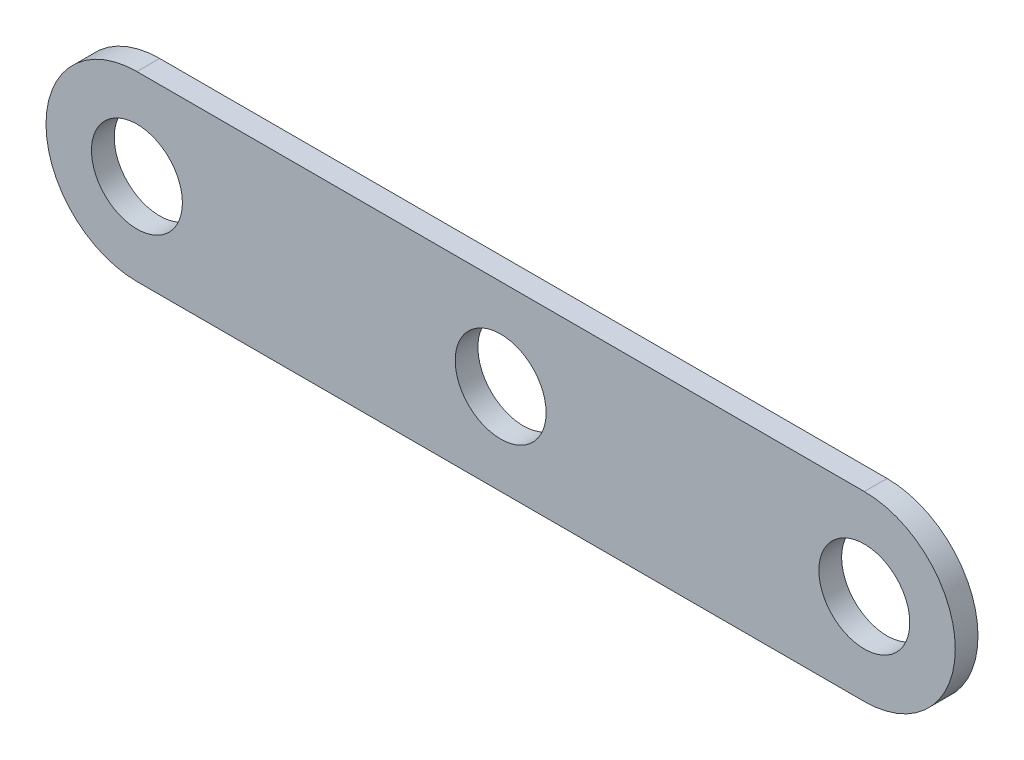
ISO-10303-21;
HEADER;
FILE_DESCRIPTION(('STEP AP214'),'2;1');
FILE_NAME('part.step','',(''),(''),'','','');
FILE_SCHEMA(('AUTOMOTIVE_DESIGN { 1 0 10303 214 1 1 1 1 }'));
ENDSEC;
DATA;
#1=APPLICATION_CONTEXT('core data for automotive mechanical design processes');
#2=APPLICATION_PROTOCOL_DEFINITION('international standard','automotive_design',2000,#1);
#3=PRODUCT_CONTEXT('',#1,'mechanical');
#4=PRODUCT('Part','Part','',(#3));
#5=PRODUCT_RELATED_PRODUCT_CATEGORY('part','',(#4));
#6=PRODUCT_DEFINITION_FORMATION('','',#4);
#7=PRODUCT_DEFINITION_CONTEXT('part definition',#1,'design');
#8=PRODUCT_DEFINITION('design','',#6,#7);
#9=PRODUCT_DEFINITION_SHAPE('','',#8);
#10=(LENGTH_UNIT() NAMED_UNIT(*) SI_UNIT(.MILLI.,.METRE.));
#11=(NAMED_UNIT(*) PLANE_ANGLE_UNIT() SI_UNIT($,.RADIAN.));
#12=(NAMED_UNIT(*) SI_UNIT($,.STERADIAN.) SOLID_ANGLE_UNIT());
#13=UNCERTAINTY_MEASURE_WITH_UNIT(LENGTH_MEASURE(1.E-05),#10,'distance_accuracy_value','');
#14=(GEOMETRIC_REPRESENTATION_CONTEXT(3) GLOBAL_UNCERTAINTY_ASSIGNED_CONTEXT((#13)) GLOBAL_UNIT_ASSIGNED_CONTEXT((#10,
#11,#12)) REPRESENTATION_CONTEXT('',''));
#15=CARTESIAN_POINT('',(0.,0.,0.));
#16=DIRECTION('',(0.,0.,1.));
#17=DIRECTION('',(1.,0.,0.));
#18=AXIS2_PLACEMENT_3D('',#15,#16,#17);
#19=CARTESIAN_POINT('',(-400.,0.,25.));
#20=DIRECTION('',(0.,0.,1.));
#21=DIRECTION('',(1.,0.,0.));
#22=AXIS2_PLACEMENT_3D('',#19,#20,#21);
#23=PLANE('',#22);
#24=CARTESIAN_POINT('',(400.,0.,25.));
#25=DIRECTION('',(0.,0.,1.));
#26=DIRECTION('',(-1.,0.,0.));
#27=AXIS2_PLACEMENT_3D('',#24,#25,#26);
#28=CIRCLE('',#27,50.);
#29=CARTESIAN_POINT('',(350.,0.,25.));
#30=VERTEX_POINT('',#29);
#31=EDGE_CURVE('E118',#30,#30,#28,.T.);
#32=ORIENTED_EDGE('',*,*,#31,.F.);
#33=EDGE_LOOP('',(#32));
#34=FACE_BOUND('',#33,.T.);
#35=CARTESIAN_POINT('',(-400.,0.,25.));
#36=DIRECTION('',(0.,0.,1.));
#37=DIRECTION('',(1.,0.,0.));
#38=AXIS2_PLACEMENT_3D('',#35,#36,#37);
#39=CIRCLE('',#38,100.);
#40=CARTESIAN_POINT('',(-400.,100.,25.));
#41=VERTEX_POINT('',#40);
#42=CARTESIAN_POINT('',(-400.,-100.,25.));
#43=VERTEX_POINT('',#42);
#44=EDGE_CURVE('E88',#41,#43,#39,.T.);
#45=ORIENTED_EDGE('',*,*,#44,.T.);
#46=DIRECTION('',(1.,0.,0.));
#47=VECTOR('',#46,1.);
#48=CARTESIAN_POINT('',(-400.,-100.,25.));
#49=LINE('',#48,#47);
#50=CARTESIAN_POINT('',(400.,-100.,25.));
#51=VERTEX_POINT('',#50);
#52=EDGE_CURVE('E83',#43,#51,#49,.T.);
#53=ORIENTED_EDGE('',*,*,#52,.T.);
#54=CARTESIAN_POINT('',(400.,1.46957615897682E-13,25.));
#55=DIRECTION('',(0.,0.,1.));
#56=DIRECTION('',(1.,0.,0.));
#57=AXIS2_PLACEMENT_3D('',#54,#55,#56);
#58=CIRCLE('',#57,100.);
#59=CARTESIAN_POINT('',(400.,100.,25.));
#60=VERTEX_POINT('',#59);
#61=EDGE_CURVE('E86',#51,#60,#58,.T.);
#62=ORIENTED_EDGE('',*,*,#61,.T.);
#63=DIRECTION('',(-1.,0.,0.));
#64=VECTOR('',#63,1.);
#65=CARTESIAN_POINT('',(-400.,100.,25.));
#66=LINE('',#65,#64);
#67=EDGE_CURVE('E53',#60,#41,#66,.T.);
#68=ORIENTED_EDGE('',*,*,#67,.T.);
#69=EDGE_LOOP('',(#45,#53,#62,#68));
#70=FACE_BOUND('',#69,.T.);
#71=CARTESIAN_POINT('',(-400.,0.,25.));
#72=DIRECTION('',(0.,0.,1.));
#73=DIRECTION('',(1.,0.,0.));
#74=AXIS2_PLACEMENT_3D('',#71,#72,#73);
#75=CIRCLE('',#74,50.);
#76=CARTESIAN_POINT('',(-350.,0.,25.));
#77=VERTEX_POINT('',#76);
#78=EDGE_CURVE('E103',#77,#77,#75,.T.);
#79=ORIENTED_EDGE('',*,*,#78,.F.);
#80=EDGE_LOOP('',(#79));
#81=FACE_BOUND('',#80,.T.);
#82=CARTESIAN_POINT('',(0.,0.,25.));
#83=DIRECTION('',(0.,0.,1.));
#84=DIRECTION('',(1.,0.,0.));
#85=AXIS2_PLACEMENT_3D('',#82,#83,#84);
#86=CIRCLE('',#85,50.);
#87=CARTESIAN_POINT('',(50.,0.,25.));
#88=VERTEX_POINT('',#87);
#89=EDGE_CURVE('E124',#88,#88,#86,.T.);
#90=ORIENTED_EDGE('',*,*,#89,.F.);
#91=EDGE_LOOP('',(#90));
#92=FACE_BOUND('',#91,.T.);
#93=ADVANCED_FACE('F36',(#34,#70,#81,#92),#23,.T.);
#94=CARTESIAN_POINT('',(-400.,0.,0.));
#95=DIRECTION('',(0.,0.,1.));
#96=DIRECTION('',(1.,0.,0.));
#97=AXIS2_PLACEMENT_3D('',#94,#95,#96);
#98=PLANE('',#97);
#99=CARTESIAN_POINT('',(-400.,0.,0.));
#100=DIRECTION('',(0.,0.,1.));
#101=DIRECTION('',(1.,0.,0.));
#102=AXIS2_PLACEMENT_3D('',#99,#100,#101);
#103=CIRCLE('',#102,100.);
#104=CARTESIAN_POINT('',(-400.,100.,0.));
#105=VERTEX_POINT('',#104);
#106=CARTESIAN_POINT('',(-400.,-100.,0.));
#107=VERTEX_POINT('',#106);
#108=EDGE_CURVE('E100',#105,#107,#103,.T.);
#109=ORIENTED_EDGE('',*,*,#108,.F.);
#110=DIRECTION('',(-1.,0.,0.));
#111=VECTOR('',#110,1.);
#112=CARTESIAN_POINT('',(-400.,100.,0.));
#113=LINE('',#112,#111);
#114=CARTESIAN_POINT('',(400.,100.,0.));
#115=VERTEX_POINT('',#114);
#116=EDGE_CURVE('E76',#115,#105,#113,.T.);
#117=ORIENTED_EDGE('',*,*,#116,.F.);
#118=CARTESIAN_POINT('',(400.,1.46957615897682E-13,0.));
#119=DIRECTION('',(0.,0.,1.));
#120=DIRECTION('',(1.,0.,0.));
#121=AXIS2_PLACEMENT_3D('',#118,#119,#120);
#122=CIRCLE('',#121,100.);
#123=CARTESIAN_POINT('',(400.,-100.,0.));
#124=VERTEX_POINT('',#123);
#125=EDGE_CURVE('E70',#124,#115,#122,.T.);
#126=ORIENTED_EDGE('',*,*,#125,.F.);
#127=DIRECTION('',(1.,0.,0.));
#128=VECTOR('',#127,1.);
#129=CARTESIAN_POINT('',(-400.,-100.,0.));
#130=LINE('',#129,#128);
#131=EDGE_CURVE('E92',#107,#124,#130,.T.);
#132=ORIENTED_EDGE('',*,*,#131,.F.);
#133=EDGE_LOOP('',(#109,#117,#126,#132));
#134=FACE_BOUND('',#133,.T.);
#135=CARTESIAN_POINT('',(-400.,0.,0.));
#136=DIRECTION('',(0.,0.,1.));
#137=DIRECTION('',(1.,0.,0.));
#138=AXIS2_PLACEMENT_3D('',#135,#136,#137);
#139=CIRCLE('',#138,50.);
#140=CARTESIAN_POINT('',(-350.,0.,0.));
#141=VERTEX_POINT('',#140);
#142=EDGE_CURVE('E115',#141,#141,#139,.T.);
#143=ORIENTED_EDGE('',*,*,#142,.T.);
#144=EDGE_LOOP('',(#143));
#145=FACE_BOUND('',#144,.T.);
#146=CARTESIAN_POINT('',(400.,0.,0.));
#147=DIRECTION('',(0.,0.,1.));
#148=DIRECTION('',(-1.,0.,0.));
#149=AXIS2_PLACEMENT_3D('',#146,#147,#148);
#150=CIRCLE('',#149,50.);
#151=CARTESIAN_POINT('',(350.,0.,0.));
#152=VERTEX_POINT('',#151);
#153=EDGE_CURVE('E121',#152,#152,#150,.T.);
#154=ORIENTED_EDGE('',*,*,#153,.T.);
#155=EDGE_LOOP('',(#154));
#156=FACE_BOUND('',#155,.T.);
#157=CARTESIAN_POINT('',(0.,0.,0.));
#158=DIRECTION('',(0.,0.,1.));
#159=DIRECTION('',(1.,0.,0.));
#160=AXIS2_PLACEMENT_3D('',#157,#158,#159);
#161=CIRCLE('',#160,50.);
#162=CARTESIAN_POINT('',(50.,0.,0.));
#163=VERTEX_POINT('',#162);
#164=EDGE_CURVE('E127',#163,#163,#161,.T.);
#165=ORIENTED_EDGE('',*,*,#164,.T.);
#166=EDGE_LOOP('',(#165));
#167=FACE_BOUND('',#166,.T.);
#168=ADVANCED_FACE('F111',(#134,#145,#156,#167),#98,.F.);
#169=CARTESIAN_POINT('',(-400.,0.,25.));
#170=DIRECTION('',(0.,0.,-1.));
#171=DIRECTION('',(-1.,0.,0.));
#172=AXIS2_PLACEMENT_3D('',#169,#170,#171);
#173=CYLINDRICAL_SURFACE('',#172,100.);
#174=ORIENTED_EDGE('',*,*,#108,.T.);
#175=DIRECTION('',(0.,0.,-1.));
#176=VECTOR('',#175,1.);
#177=CARTESIAN_POINT('',(-400.,-100.,25.));
#178=LINE('',#177,#176);
#179=EDGE_CURVE('E11',#43,#107,#178,.T.);
#180=ORIENTED_EDGE('',*,*,#179,.F.);
#181=ORIENTED_EDGE('',*,*,#44,.F.);
#182=DIRECTION('',(0.,0.,-1.));
#183=VECTOR('',#182,1.);
#184=CARTESIAN_POINT('',(-400.,100.,25.));
#185=LINE('',#184,#183);
#186=EDGE_CURVE('E96',#41,#105,#185,.T.);
#187=ORIENTED_EDGE('',*,*,#186,.T.);
#188=EDGE_LOOP('',(#174,#180,#181,#187));
#189=FACE_BOUND('',#188,.T.);
#190=ADVANCED_FACE('F38',(#189),#173,.T.);
#191=CARTESIAN_POINT('',(-400.,-100.,25.));
#192=DIRECTION('',(0.,1.,0.));
#193=DIRECTION('',(-1.,0.,0.));
#194=AXIS2_PLACEMENT_3D('',#191,#192,#193);
#195=PLANE('',#194);
#196=ORIENTED_EDGE('',*,*,#131,.T.);
#197=DIRECTION('',(0.,0.,-1.));
#198=VECTOR('',#197,1.);
#199=CARTESIAN_POINT('',(400.,-100.,25.));
#200=LINE('',#199,#198);
#201=EDGE_CURVE('E45',#51,#124,#200,.T.);
#202=ORIENTED_EDGE('',*,*,#201,.F.);
#203=ORIENTED_EDGE('',*,*,#52,.F.);
#204=ORIENTED_EDGE('',*,*,#179,.T.);
#205=EDGE_LOOP('',(#196,#202,#203,#204));
#206=FACE_BOUND('',#205,.T.);
#207=ADVANCED_FACE('F91',(#206),#195,.F.);
#208=CARTESIAN_POINT('',(400.,1.46957615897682E-13,25.));
#209=DIRECTION('',(0.,0.,-1.));
#210=DIRECTION('',(-1.,0.,0.));
#211=AXIS2_PLACEMENT_3D('',#208,#209,#210);
#212=CYLINDRICAL_SURFACE('',#211,100.);
#213=ORIENTED_EDGE('',*,*,#125,.T.);
#214=DIRECTION('',(0.,0.,-1.));
#215=VECTOR('',#214,1.);
#216=CARTESIAN_POINT('',(400.,100.,25.));
#217=LINE('',#216,#215);
#218=EDGE_CURVE('E93',#60,#115,#217,.T.);
#219=ORIENTED_EDGE('',*,*,#218,.F.);
#220=ORIENTED_EDGE('',*,*,#61,.F.);
#221=ORIENTED_EDGE('',*,*,#201,.T.);
#222=EDGE_LOOP('',(#213,#219,#220,#221));
#223=FACE_BOUND('',#222,.T.);
#224=ADVANCED_FACE('F94',(#223),#212,.T.);
#225=CARTESIAN_POINT('',(-400.,100.,25.));
#226=DIRECTION('',(0.,-1.,0.));
#227=DIRECTION('',(1.,0.,0.));
#228=AXIS2_PLACEMENT_3D('',#225,#226,#227);
#229=PLANE('',#228);
#230=ORIENTED_EDGE('',*,*,#116,.T.);
#231=ORIENTED_EDGE('',*,*,#186,.F.);
#232=ORIENTED_EDGE('',*,*,#67,.F.);
#233=ORIENTED_EDGE('',*,*,#218,.T.);
#234=EDGE_LOOP('',(#230,#231,#232,#233));
#235=FACE_BOUND('',#234,.T.);
#236=ADVANCED_FACE('F108',(#235),#229,.F.);
#237=CARTESIAN_POINT('',(-400.,0.,25.));
#238=DIRECTION('',(0.,0.,-1.));
#239=DIRECTION('',(-1.,0.,0.));
#240=AXIS2_PLACEMENT_3D('',#237,#238,#239);
#241=CYLINDRICAL_SURFACE('',#240,50.);
#242=ORIENTED_EDGE('',*,*,#78,.T.);
#243=EDGE_LOOP('',(#242));
#244=FACE_BOUND('',#243,.T.);
#245=ORIENTED_EDGE('',*,*,#142,.F.);
#246=EDGE_LOOP('',(#245));
#247=FACE_BOUND('',#246,.T.);
#248=ADVANCED_FACE('F145',(#244,#247),#241,.F.);
#249=CARTESIAN_POINT('',(400.,0.,25.));
#250=DIRECTION('',(0.,0.,-1.));
#251=DIRECTION('',(-1.,0.,0.));
#252=AXIS2_PLACEMENT_3D('',#249,#250,#251);
#253=CYLINDRICAL_SURFACE('',#252,50.);
#254=ORIENTED_EDGE('',*,*,#31,.T.);
#255=EDGE_LOOP('',(#254));
#256=FACE_BOUND('',#255,.T.);
#257=ORIENTED_EDGE('',*,*,#153,.F.);
#258=EDGE_LOOP('',(#257));
#259=FACE_BOUND('',#258,.T.);
#260=ADVANCED_FACE('F191',(#256,#259),#253,.F.);
#261=CARTESIAN_POINT('',(0.,0.,25.));
#262=DIRECTION('',(0.,0.,-1.));
#263=DIRECTION('',(-1.,0.,0.));
#264=AXIS2_PLACEMENT_3D('',#261,#262,#263);
#265=CYLINDRICAL_SURFACE('',#264,50.);
#266=ORIENTED_EDGE('',*,*,#89,.T.);
#267=EDGE_LOOP('',(#266));
#268=FACE_BOUND('',#267,.T.);
#269=ORIENTED_EDGE('',*,*,#164,.F.);
#270=EDGE_LOOP('',(#269));
#271=FACE_BOUND('',#270,.T.);
#272=ADVANCED_FACE('F133',(#268,#271),#265,.F.);
#273=CLOSED_SHELL('',(#93,#168,#190,#207,#224,#236,#248,#260,#272));
#274=MANIFOLD_SOLID_BREP('B2',#273);
#275=ADVANCED_BREP_SHAPE_REPRESENTATION('',(#18,#274),#14);
#276=SHAPE_DEFINITION_REPRESENTATION(#9,#275);
ENDSEC;
END-ISO-10303-21;
